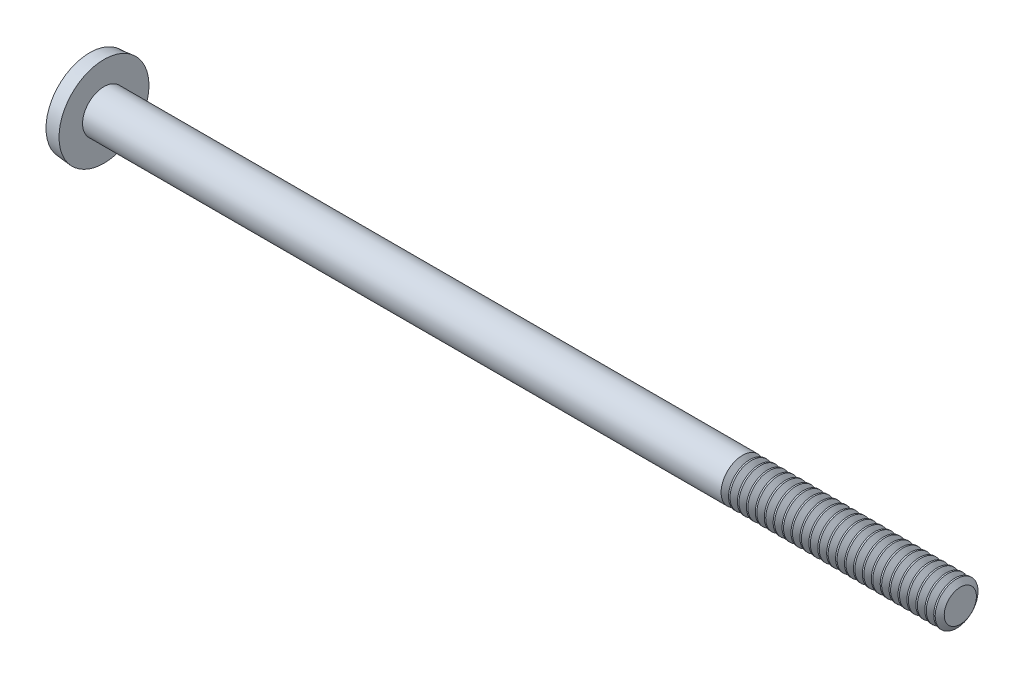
from build123d import *

# Parameters (mm, degrees)
CIRPATTERN1_COUNT = 2
CIRPATTERN1_ANGLE = 90
THDSCHPAT_COUNT   = 25
THDSCHPAT_PITCH   = 0.3175


with BuildPart() as part:
    # BodySke → Base-Revolve (revolve)
    with BuildSketch(Plane.XY, mode=Mode.PRIVATE) as base_revolve_sk:
        with BuildLine():
            Line((0.8128, 0.762), (0.8128, 1.6002))
            Line((0.8128, 1.6002), (0.3048, 1.555755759))
            ThreePointArc((0.3048, 1.555755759), (0.076917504, 0.792666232), (0, 0))
            Line((0, 0), (31.2928, 0))
            Line((31.2928, 0), (31.2928, 0.762))
            Line((31.2928, 0.762), (0.8128, 0.762))
        make_face()
    revolve(base_revolve_sk.sketch.rotate(Axis((-25.4, 0, 0), (1, 0, 0)), 90), axis=Axis((-25.4, 0, 0), (1, 0, 0)))

    # Sketch3 → Cross section 0
    with BuildSketch(Plane(origin=(0, 0, 0), x_dir=(0, 0, -1), z_dir=(1, 0, 0))):
        with BuildLine():
            Line((-0.2921, 1.0541), (0.2921, 1.0541))
            Line((0.2921, 1.0541), (0.2921, -1.0541))
            Line((0.2921, -1.0541), (-0.2921, -1.0541))
            Line((-0.2921, -1.0541), (-0.2921, 1.0541))
        make_face()
    # Sketch4 → Cross section 1
    with BuildSketch(Plane(origin=(1.0668, 0, 0), x_dir=(0, 0, -1), z_dir=(1, 0, 0))):
        with BuildLine():
            Line((-0.14605, 0.14605), (0.14605, 0.14605))
            Line((0.14605, 0.14605), (0.14605, -0.14605))
            Line((0.14605, -0.14605), (-0.14605, -0.14605))
            Line((-0.14605, -0.14605), (-0.14605, 0.14605))
        make_face()
    cross = loft(mode=Mode.SUBTRACT)

    # CirPattern1: Cross ×2 about axis
    cirpattern1_axis = Axis((0, 0, 0), (1, 0, 0))
    for i in range(1, CIRPATTERN1_COUNT):
        add(cross.rotate(cirpattern1_axis, i * CIRPATTERN1_ANGLE / (CIRPATTERN1_COUNT - 1)), mode=Mode.SUBTRACT)

    # ThdSchSke → ThreadSchematic (revolve, cut)
    with BuildSketch(Plane.XY, mode=Mode.PRIVATE) as threadschematic_sk:
        Polygon((23.6728, -0.57277), (23.540299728, -0.762), (23.540299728, -0.9525), (23.805300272, -0.9525), (23.805300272, -0.762), align=None)
    threadschematic = revolve(threadschematic_sk.sketch.rotate(Axis((-3.175, 0, 0), (1, 0, 0)), 270), axis=Axis((-3.175, 0, 0), (1, 0, 0)), mode=Mode.SUBTRACT)

    # ThdSchPat: ThreadSchematic ×25
    with Locations(*[(i * THDSCHPAT_PITCH, 0, 0) for i in range(1, THDSCHPAT_COUNT)]):
        add(threadschematic, mode=Mode.SUBTRACT)


solid = part.part
